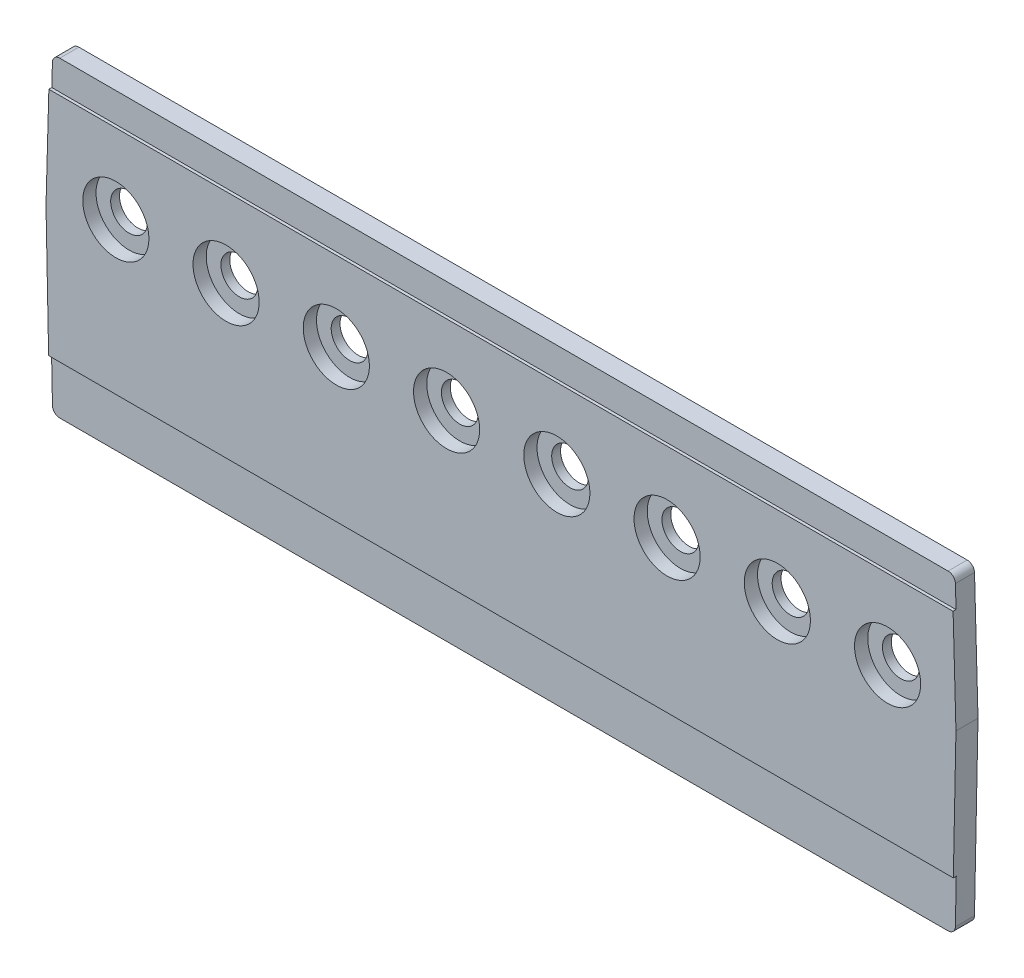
ISO-10303-21;
HEADER;
FILE_DESCRIPTION(('STEP AP214'),'2;1');
FILE_NAME('part.step','',(''),(''),'','','');
FILE_SCHEMA(('AUTOMOTIVE_DESIGN { 1 0 10303 214 1 1 1 1 }'));
ENDSEC;
DATA;
#1=APPLICATION_CONTEXT('core data for automotive mechanical design processes');
#2=APPLICATION_PROTOCOL_DEFINITION('international standard','automotive_design',2000,#1);
#3=PRODUCT_CONTEXT('',#1,'mechanical');
#4=PRODUCT('Part','Part','',(#3));
#5=PRODUCT_RELATED_PRODUCT_CATEGORY('part','',(#4));
#6=PRODUCT_DEFINITION_FORMATION('','',#4);
#7=PRODUCT_DEFINITION_CONTEXT('part definition',#1,'design');
#8=PRODUCT_DEFINITION('design','',#6,#7);
#9=PRODUCT_DEFINITION_SHAPE('','',#8);
#10=(LENGTH_UNIT() NAMED_UNIT(*) SI_UNIT(.MILLI.,.METRE.));
#11=(NAMED_UNIT(*) PLANE_ANGLE_UNIT() SI_UNIT($,.RADIAN.));
#12=(NAMED_UNIT(*) SI_UNIT($,.STERADIAN.) SOLID_ANGLE_UNIT());
#13=UNCERTAINTY_MEASURE_WITH_UNIT(LENGTH_MEASURE(1.E-05),#10,'distance_accuracy_value','');
#14=(GEOMETRIC_REPRESENTATION_CONTEXT(3) GLOBAL_UNCERTAINTY_ASSIGNED_CONTEXT((#13)) GLOBAL_UNIT_ASSIGNED_CONTEXT((#10,
#11,#12)) REPRESENTATION_CONTEXT('',''));
#15=CARTESIAN_POINT('',(0.,0.,0.));
#16=DIRECTION('',(0.,0.,1.));
#17=DIRECTION('',(1.,0.,0.));
#18=AXIS2_PLACEMENT_3D('',#15,#16,#17);
#19=CARTESIAN_POINT('',(122.32019993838,1.,3.));
#20=DIRECTION('',(0.,0.,-1.));
#21=DIRECTION('',(-1.,0.,0.));
#22=AXIS2_PLACEMENT_3D('',#19,#20,#21);
#23=CYLINDRICAL_SURFACE('',#22,1.);
#24=CARTESIAN_POINT('',(122.32019993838,1.,2.6));
#25=DIRECTION('',(0.,0.,1.));
#26=DIRECTION('',(1.,0.,0.));
#27=AXIS2_PLACEMENT_3D('',#24,#25,#26);
#28=CIRCLE('',#27,1.);
#29=CARTESIAN_POINT('',(122.32019993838,0.,2.6));
#30=VERTEX_POINT('',#29);
#31=CARTESIAN_POINT('',(123.319991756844,0.979596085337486,2.6));
#32=VERTEX_POINT('',#31);
#33=EDGE_CURVE('E143',#30,#32,#28,.T.);
#34=ORIENTED_EDGE('',*,*,#33,.F.);
#35=DIRECTION('',(0.,0.,-1.));
#36=VECTOR('',#35,1.);
#37=CARTESIAN_POINT('',(122.32019993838,0.,3.));
#38=LINE('',#37,#36);
#39=CARTESIAN_POINT('',(122.32019993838,0.,0.));
#40=VERTEX_POINT('',#39);
#41=EDGE_CURVE('E172',#30,#40,#38,.T.);
#42=ORIENTED_EDGE('',*,*,#41,.T.);
#43=CARTESIAN_POINT('',(122.32019993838,1.,0.));
#44=DIRECTION('',(0.,0.,1.));
#45=DIRECTION('',(-1.,0.,0.));
#46=AXIS2_PLACEMENT_3D('',#43,#44,#45);
#47=CIRCLE('',#46,1.);
#48=CARTESIAN_POINT('',(123.319991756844,0.979596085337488,0.));
#49=VERTEX_POINT('',#48);
#50=EDGE_CURVE('E173',#40,#49,#47,.T.);
#51=ORIENTED_EDGE('',*,*,#50,.T.);
#52=DIRECTION('',(0.,0.,-1.));
#53=VECTOR('',#52,1.);
#54=CARTESIAN_POINT('',(123.319991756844,0.979596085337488,3.));
#55=LINE('',#54,#53);
#56=EDGE_CURVE('E214',#32,#49,#55,.T.);
#57=ORIENTED_EDGE('',*,*,#56,.F.);
#58=EDGE_LOOP('',(#34,#42,#51,#57));
#59=FACE_BOUND('',#58,.T.);
#60=ADVANCED_FACE('F33',(#59),#23,.T.);
#61=CARTESIAN_POINT('',(1.47980006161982,1.,3.));
#62=DIRECTION('',(0.,0.,-1.));
#63=DIRECTION('',(-1.,0.,0.));
#64=AXIS2_PLACEMENT_3D('',#61,#62,#63);
#65=CYLINDRICAL_SURFACE('',#64,1.);
#66=CARTESIAN_POINT('',(1.47980006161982,1.,2.6));
#67=DIRECTION('',(0.,0.,1.));
#68=DIRECTION('',(1.,0.,0.));
#69=AXIS2_PLACEMENT_3D('',#66,#67,#68);
#70=CIRCLE('',#69,1.);
#71=CARTESIAN_POINT('',(0.480008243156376,0.979596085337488,2.6));
#72=VERTEX_POINT('',#71);
#73=CARTESIAN_POINT('',(1.47980006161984,0.,2.6));
#74=VERTEX_POINT('',#73);
#75=EDGE_CURVE('E47',#72,#74,#70,.T.);
#76=ORIENTED_EDGE('',*,*,#75,.F.);
#77=DIRECTION('',(0.,0.,-1.));
#78=VECTOR('',#77,1.);
#79=CARTESIAN_POINT('',(0.480008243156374,0.979596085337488,3.));
#80=LINE('',#79,#78);
#81=CARTESIAN_POINT('',(0.480008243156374,0.979596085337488,0.));
#82=VERTEX_POINT('',#81);
#83=EDGE_CURVE('E200',#72,#82,#80,.T.);
#84=ORIENTED_EDGE('',*,*,#83,.T.);
#85=CARTESIAN_POINT('',(1.47980006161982,1.,0.));
#86=DIRECTION('',(0.,0.,1.));
#87=DIRECTION('',(1.,0.,0.));
#88=AXIS2_PLACEMENT_3D('',#85,#86,#87);
#89=CIRCLE('',#88,1.);
#90=CARTESIAN_POINT('',(1.47980006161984,0.,0.));
#91=VERTEX_POINT('',#90);
#92=EDGE_CURVE('E164',#82,#91,#89,.T.);
#93=ORIENTED_EDGE('',*,*,#92,.T.);
#94=DIRECTION('',(0.,0.,-1.));
#95=VECTOR('',#94,1.);
#96=CARTESIAN_POINT('',(1.47980006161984,0.,3.));
#97=LINE('',#96,#95);
#98=EDGE_CURVE('E198',#74,#91,#97,.T.);
#99=ORIENTED_EDGE('',*,*,#98,.F.);
#100=EDGE_LOOP('',(#76,#84,#93,#99));
#101=FACE_BOUND('',#100,.T.);
#102=ADVANCED_FACE('F402',(#101),#65,.T.);
#103=CARTESIAN_POINT('',(1.47980006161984,0.,3.));
#104=DIRECTION('',(0.,1.,0.));
#105=DIRECTION('',(0.,0.,1.));
#106=AXIS2_PLACEMENT_3D('',#103,#104,#105);
#107=PLANE('',#106);
#108=DIRECTION('',(1.,0.,0.));
#109=VECTOR('',#108,1.);
#110=CARTESIAN_POINT('',(1.47980006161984,0.,2.6));
#111=LINE('',#110,#109);
#112=EDGE_CURVE('E40',#74,#30,#111,.T.);
#113=ORIENTED_EDGE('',*,*,#112,.F.);
#114=ORIENTED_EDGE('',*,*,#98,.T.);
#115=DIRECTION('',(1.,0.,0.));
#116=VECTOR('',#115,1.);
#117=CARTESIAN_POINT('',(1.47980006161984,0.,0.));
#118=LINE('',#117,#116);
#119=EDGE_CURVE('E159',#91,#40,#118,.T.);
#120=ORIENTED_EDGE('',*,*,#119,.T.);
#121=ORIENTED_EDGE('',*,*,#41,.F.);
#122=EDGE_LOOP('',(#113,#114,#120,#121));
#123=FACE_BOUND('',#122,.T.);
#124=ADVANCED_FACE('F269',(#123),#107,.F.);
#125=CARTESIAN_POINT('',(122.327542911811,41.4,3.));
#126=DIRECTION('',(0.,0.,-1.));
#127=DIRECTION('',(-1.,0.,0.));
#128=AXIS2_PLACEMENT_3D('',#125,#126,#127);
#129=CYLINDRICAL_SURFACE('',#128,0.999999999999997);
#130=CARTESIAN_POINT('',(122.327542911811,41.4,2.6));
#131=DIRECTION('',(0.,0.,1.));
#132=DIRECTION('',(1.,0.,0.));
#133=AXIS2_PLACEMENT_3D('',#130,#131,#132);
#134=CIRCLE('',#133,0.999999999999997);
#135=CARTESIAN_POINT('',(123.327153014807,41.4279220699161,2.6));
#136=VERTEX_POINT('',#135);
#137=CARTESIAN_POINT('',(122.327542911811,42.4,2.6));
#138=VERTEX_POINT('',#137);
#139=EDGE_CURVE('E310',#136,#138,#134,.T.);
#140=ORIENTED_EDGE('',*,*,#139,.F.);
#141=DIRECTION('',(0.,0.,-1.));
#142=VECTOR('',#141,1.);
#143=CARTESIAN_POINT('',(123.327153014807,41.4279220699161,3.));
#144=LINE('',#143,#142);
#145=CARTESIAN_POINT('',(123.327153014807,41.4279220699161,0.));
#146=VERTEX_POINT('',#145);
#147=EDGE_CURVE('E211',#136,#146,#144,.T.);
#148=ORIENTED_EDGE('',*,*,#147,.T.);
#149=CARTESIAN_POINT('',(122.327542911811,41.4,0.));
#150=DIRECTION('',(0.,0.,1.));
#151=DIRECTION('',(1.,0.,0.));
#152=AXIS2_PLACEMENT_3D('',#149,#150,#151);
#153=CIRCLE('',#152,0.999999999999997);
#154=CARTESIAN_POINT('',(122.327542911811,42.4,0.));
#155=VERTEX_POINT('',#154);
#156=EDGE_CURVE('E181',#146,#155,#153,.T.);
#157=ORIENTED_EDGE('',*,*,#156,.T.);
#158=DIRECTION('',(0.,0.,-1.));
#159=VECTOR('',#158,1.);
#160=CARTESIAN_POINT('',(122.327542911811,42.4,3.));
#161=LINE('',#160,#159);
#162=EDGE_CURVE('E209',#138,#155,#161,.T.);
#163=ORIENTED_EDGE('',*,*,#162,.F.);
#164=EDGE_LOOP('',(#140,#148,#157,#163));
#165=FACE_BOUND('',#164,.T.);
#166=ADVANCED_FACE('F411',(#165),#129,.T.);
#167=CARTESIAN_POINT('',(1.47245708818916,42.4,3.));
#168=DIRECTION('',(0.,-1.,0.));
#169=DIRECTION('',(0.,0.,-1.));
#170=AXIS2_PLACEMENT_3D('',#167,#168,#169);
#171=PLANE('',#170);
#172=DIRECTION('',(-1.,0.,0.));
#173=VECTOR('',#172,1.);
#174=CARTESIAN_POINT('',(0.,42.4,2.6));
#175=LINE('',#174,#173);
#176=CARTESIAN_POINT('',(1.47245708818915,42.4,2.6));
#177=VERTEX_POINT('',#176);
#178=EDGE_CURVE('E307',#138,#177,#175,.T.);
#179=ORIENTED_EDGE('',*,*,#178,.F.);
#180=ORIENTED_EDGE('',*,*,#162,.T.);
#181=DIRECTION('',(-1.,0.,0.));
#182=VECTOR('',#181,1.);
#183=CARTESIAN_POINT('',(1.47245708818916,42.4,0.));
#184=LINE('',#183,#182);
#185=CARTESIAN_POINT('',(1.47245708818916,42.4,0.));
#186=VERTEX_POINT('',#185);
#187=EDGE_CURVE('E184',#155,#186,#184,.T.);
#188=ORIENTED_EDGE('',*,*,#187,.T.);
#189=DIRECTION('',(0.,0.,-1.));
#190=VECTOR('',#189,1.);
#191=CARTESIAN_POINT('',(1.47245708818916,42.4,3.));
#192=LINE('',#191,#190);
#193=EDGE_CURVE('E207',#177,#186,#192,.T.);
#194=ORIENTED_EDGE('',*,*,#193,.F.);
#195=EDGE_LOOP('',(#179,#180,#188,#194));
#196=FACE_BOUND('',#195,.T.);
#197=ADVANCED_FACE('F422',(#196),#171,.F.);
#198=CARTESIAN_POINT('',(1.47245708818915,41.4,3.));
#199=DIRECTION('',(0.,0.,-1.));
#200=DIRECTION('',(-1.,0.,0.));
#201=AXIS2_PLACEMENT_3D('',#198,#199,#200);
#202=CYLINDRICAL_SURFACE('',#201,0.999999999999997);
#203=CARTESIAN_POINT('',(1.47245708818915,41.4,2.6));
#204=DIRECTION('',(0.,0.,1.));
#205=DIRECTION('',(1.,0.,0.));
#206=AXIS2_PLACEMENT_3D('',#203,#204,#205);
#207=CIRCLE('',#206,0.999999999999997);
#208=CARTESIAN_POINT('',(0.472846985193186,41.4279220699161,2.6));
#209=VERTEX_POINT('',#208);
#210=EDGE_CURVE('E55',#177,#209,#207,.T.);
#211=ORIENTED_EDGE('',*,*,#210,.F.);
#212=ORIENTED_EDGE('',*,*,#193,.T.);
#213=CARTESIAN_POINT('',(1.47245708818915,41.4,0.));
#214=DIRECTION('',(0.,0.,1.));
#215=DIRECTION('',(-1.,0.,0.));
#216=AXIS2_PLACEMENT_3D('',#213,#214,#215);
#217=CIRCLE('',#216,0.999999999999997);
#218=CARTESIAN_POINT('',(0.472846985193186,41.4279220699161,0.));
#219=VERTEX_POINT('',#218);
#220=EDGE_CURVE('E187',#186,#219,#217,.T.);
#221=ORIENTED_EDGE('',*,*,#220,.T.);
#222=DIRECTION('',(0.,0.,-1.));
#223=VECTOR('',#222,1.);
#224=CARTESIAN_POINT('',(0.472846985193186,41.4279220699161,3.));
#225=LINE('',#224,#223);
#226=EDGE_CURVE('E205',#209,#219,#225,.T.);
#227=ORIENTED_EDGE('',*,*,#226,.F.);
#228=EDGE_LOOP('',(#211,#212,#221,#227));
#229=FACE_BOUND('',#228,.T.);
#230=ADVANCED_FACE('F418',(#229),#202,.T.);
#231=CARTESIAN_POINT('',(114.5,27.6,3.));
#232=DIRECTION('',(0.,0.,-1.));
#233=DIRECTION('',(-1.,0.,0.));
#234=AXIS2_PLACEMENT_3D('',#231,#232,#233);
#235=CYLINDRICAL_SURFACE('',#234,2.50000000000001);
#236=CARTESIAN_POINT('',(114.5,27.6,0.));
#237=DIRECTION('',(0.,0.,1.));
#238=DIRECTION('',(1.,0.,0.));
#239=AXIS2_PLACEMENT_3D('',#236,#237,#238);
#240=CIRCLE('',#239,2.50000000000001);
#241=CARTESIAN_POINT('',(117.,27.6,0.));
#242=VERTEX_POINT('',#241);
#243=EDGE_CURVE('E220',#242,#242,#240,.T.);
#244=ORIENTED_EDGE('',*,*,#243,.F.);
#245=EDGE_LOOP('',(#244));
#246=FACE_BOUND('',#245,.T.);
#247=CARTESIAN_POINT('',(114.5,27.6,1.2));
#248=DIRECTION('',(0.,0.,1.));
#249=DIRECTION('',(1.,0.,0.));
#250=AXIS2_PLACEMENT_3D('',#247,#248,#249);
#251=CIRCLE('',#250,2.50000000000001);
#252=CARTESIAN_POINT('',(117.,27.6,1.2));
#253=VERTEX_POINT('',#252);
#254=EDGE_CURVE('E252',#253,#253,#251,.T.);
#255=ORIENTED_EDGE('',*,*,#254,.T.);
#256=EDGE_LOOP('',(#255));
#257=FACE_BOUND('',#256,.T.);
#258=ADVANCED_FACE('F421',(#246,#257),#235,.F.);
#259=CARTESIAN_POINT('',(99.5,27.6,3.));
#260=DIRECTION('',(0.,0.,-1.));
#261=DIRECTION('',(-1.,0.,0.));
#262=AXIS2_PLACEMENT_3D('',#259,#260,#261);
#263=CYLINDRICAL_SURFACE('',#262,2.50000000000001);
#264=CARTESIAN_POINT('',(99.5,27.6,0.));
#265=DIRECTION('',(0.,0.,1.));
#266=DIRECTION('',(1.,0.,0.));
#267=AXIS2_PLACEMENT_3D('',#264,#265,#266);
#268=CIRCLE('',#267,2.50000000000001);
#269=CARTESIAN_POINT('',(102.,27.6,0.));
#270=VERTEX_POINT('',#269);
#271=EDGE_CURVE('E350',#270,#270,#268,.T.);
#272=ORIENTED_EDGE('',*,*,#271,.F.);
#273=EDGE_LOOP('',(#272));
#274=FACE_BOUND('',#273,.T.);
#275=CARTESIAN_POINT('',(99.5,27.6,1.2));
#276=DIRECTION('',(0.,0.,1.));
#277=DIRECTION('',(1.,0.,0.));
#278=AXIS2_PLACEMENT_3D('',#275,#276,#277);
#279=CIRCLE('',#278,2.50000000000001);
#280=CARTESIAN_POINT('',(102.,27.6,1.2));
#281=VERTEX_POINT('',#280);
#282=EDGE_CURVE('E247',#281,#281,#279,.T.);
#283=ORIENTED_EDGE('',*,*,#282,.T.);
#284=EDGE_LOOP('',(#283));
#285=FACE_BOUND('',#284,.T.);
#286=ADVANCED_FACE('F670',(#274,#285),#263,.F.);
#287=CARTESIAN_POINT('',(84.5,27.6,3.));
#288=DIRECTION('',(0.,0.,-1.));
#289=DIRECTION('',(-1.,0.,0.));
#290=AXIS2_PLACEMENT_3D('',#287,#288,#289);
#291=CYLINDRICAL_SURFACE('',#290,2.5);
#292=CARTESIAN_POINT('',(84.5,27.6,0.));
#293=DIRECTION('',(0.,0.,1.));
#294=DIRECTION('',(1.,0.,0.));
#295=AXIS2_PLACEMENT_3D('',#292,#293,#294);
#296=CIRCLE('',#295,2.5);
#297=CARTESIAN_POINT('',(87.,27.6,0.));
#298=VERTEX_POINT('',#297);
#299=EDGE_CURVE('E353',#298,#298,#296,.T.);
#300=ORIENTED_EDGE('',*,*,#299,.F.);
#301=EDGE_LOOP('',(#300));
#302=FACE_BOUND('',#301,.T.);
#303=CARTESIAN_POINT('',(84.5,27.6,1.2));
#304=DIRECTION('',(0.,0.,1.));
#305=DIRECTION('',(1.,0.,0.));
#306=AXIS2_PLACEMENT_3D('',#303,#304,#305);
#307=CIRCLE('',#306,2.5);
#308=CARTESIAN_POINT('',(87.,27.6,1.2));
#309=VERTEX_POINT('',#308);
#310=EDGE_CURVE('E242',#309,#309,#307,.T.);
#311=ORIENTED_EDGE('',*,*,#310,.T.);
#312=EDGE_LOOP('',(#311));
#313=FACE_BOUND('',#312,.T.);
#314=ADVANCED_FACE('F679',(#302,#313),#291,.F.);
#315=CARTESIAN_POINT('',(69.5,27.6,3.));
#316=DIRECTION('',(0.,0.,-1.));
#317=DIRECTION('',(-1.,0.,0.));
#318=AXIS2_PLACEMENT_3D('',#315,#316,#317);
#319=CYLINDRICAL_SURFACE('',#318,2.50000000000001);
#320=CARTESIAN_POINT('',(69.5,27.6,0.));
#321=DIRECTION('',(0.,0.,1.));
#322=DIRECTION('',(1.,0.,0.));
#323=AXIS2_PLACEMENT_3D('',#320,#321,#322);
#324=CIRCLE('',#323,2.50000000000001);
#325=CARTESIAN_POINT('',(72.,27.6,0.));
#326=VERTEX_POINT('',#325);
#327=EDGE_CURVE('E356',#326,#326,#324,.T.);
#328=ORIENTED_EDGE('',*,*,#327,.F.);
#329=EDGE_LOOP('',(#328));
#330=FACE_BOUND('',#329,.T.);
#331=CARTESIAN_POINT('',(69.5,27.6,1.2));
#332=DIRECTION('',(0.,0.,1.));
#333=DIRECTION('',(1.,0.,0.));
#334=AXIS2_PLACEMENT_3D('',#331,#332,#333);
#335=CIRCLE('',#334,2.50000000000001);
#336=CARTESIAN_POINT('',(72.,27.6,1.2));
#337=VERTEX_POINT('',#336);
#338=EDGE_CURVE('E237',#337,#337,#335,.T.);
#339=ORIENTED_EDGE('',*,*,#338,.T.);
#340=EDGE_LOOP('',(#339));
#341=FACE_BOUND('',#340,.T.);
#342=ADVANCED_FACE('F688',(#330,#341),#319,.F.);
#343=CARTESIAN_POINT('',(54.5,27.6,3.));
#344=DIRECTION('',(0.,0.,-1.));
#345=DIRECTION('',(-1.,0.,0.));
#346=AXIS2_PLACEMENT_3D('',#343,#344,#345);
#347=CYLINDRICAL_SURFACE('',#346,2.5);
#348=CARTESIAN_POINT('',(54.5,27.6,0.));
#349=DIRECTION('',(0.,0.,1.));
#350=DIRECTION('',(1.,0.,0.));
#351=AXIS2_PLACEMENT_3D('',#348,#349,#350);
#352=CIRCLE('',#351,2.5);
#353=CARTESIAN_POINT('',(57.,27.6,0.));
#354=VERTEX_POINT('',#353);
#355=EDGE_CURVE('E359',#354,#354,#352,.T.);
#356=ORIENTED_EDGE('',*,*,#355,.F.);
#357=EDGE_LOOP('',(#356));
#358=FACE_BOUND('',#357,.T.);
#359=CARTESIAN_POINT('',(54.5,27.6,1.2));
#360=DIRECTION('',(0.,0.,1.));
#361=DIRECTION('',(1.,0.,0.));
#362=AXIS2_PLACEMENT_3D('',#359,#360,#361);
#363=CIRCLE('',#362,2.5);
#364=CARTESIAN_POINT('',(57.,27.6,1.2));
#365=VERTEX_POINT('',#364);
#366=EDGE_CURVE('E232',#365,#365,#363,.T.);
#367=ORIENTED_EDGE('',*,*,#366,.T.);
#368=EDGE_LOOP('',(#367));
#369=FACE_BOUND('',#368,.T.);
#370=ADVANCED_FACE('F697',(#358,#369),#347,.F.);
#371=CARTESIAN_POINT('',(39.5,27.6,3.));
#372=DIRECTION('',(0.,0.,-1.));
#373=DIRECTION('',(-1.,0.,0.));
#374=AXIS2_PLACEMENT_3D('',#371,#372,#373);
#375=CYLINDRICAL_SURFACE('',#374,2.5);
#376=CARTESIAN_POINT('',(39.5,27.6,0.));
#377=DIRECTION('',(0.,0.,1.));
#378=DIRECTION('',(1.,0.,0.));
#379=AXIS2_PLACEMENT_3D('',#376,#377,#378);
#380=CIRCLE('',#379,2.5);
#381=CARTESIAN_POINT('',(42.,27.6,0.));
#382=VERTEX_POINT('',#381);
#383=EDGE_CURVE('E362',#382,#382,#380,.T.);
#384=ORIENTED_EDGE('',*,*,#383,.F.);
#385=EDGE_LOOP('',(#384));
#386=FACE_BOUND('',#385,.T.);
#387=CARTESIAN_POINT('',(39.5,27.6,1.2));
#388=DIRECTION('',(0.,0.,1.));
#389=DIRECTION('',(1.,0.,0.));
#390=AXIS2_PLACEMENT_3D('',#387,#388,#389);
#391=CIRCLE('',#390,2.5);
#392=CARTESIAN_POINT('',(42.,27.6,1.2));
#393=VERTEX_POINT('',#392);
#394=EDGE_CURVE('E227',#393,#393,#391,.T.);
#395=ORIENTED_EDGE('',*,*,#394,.T.);
#396=EDGE_LOOP('',(#395));
#397=FACE_BOUND('',#396,.T.);
#398=ADVANCED_FACE('F706',(#386,#397),#375,.F.);
#399=CARTESIAN_POINT('',(24.5,27.6,3.));
#400=DIRECTION('',(0.,0.,-1.));
#401=DIRECTION('',(-1.,0.,0.));
#402=AXIS2_PLACEMENT_3D('',#399,#400,#401);
#403=CYLINDRICAL_SURFACE('',#402,2.5);
#404=CARTESIAN_POINT('',(24.5,27.6,0.));
#405=DIRECTION('',(0.,0.,1.));
#406=DIRECTION('',(1.,0.,0.));
#407=AXIS2_PLACEMENT_3D('',#404,#405,#406);
#408=CIRCLE('',#407,2.5);
#409=CARTESIAN_POINT('',(27.,27.6,0.));
#410=VERTEX_POINT('',#409);
#411=EDGE_CURVE('E364',#410,#410,#408,.T.);
#412=ORIENTED_EDGE('',*,*,#411,.F.);
#413=EDGE_LOOP('',(#412));
#414=FACE_BOUND('',#413,.T.);
#415=CARTESIAN_POINT('',(24.5,27.6,1.2));
#416=DIRECTION('',(0.,0.,1.));
#417=DIRECTION('',(1.,0.,0.));
#418=AXIS2_PLACEMENT_3D('',#415,#416,#417);
#419=CIRCLE('',#418,2.5);
#420=CARTESIAN_POINT('',(27.,27.6,1.2));
#421=VERTEX_POINT('',#420);
#422=EDGE_CURVE('E222',#421,#421,#419,.T.);
#423=ORIENTED_EDGE('',*,*,#422,.T.);
#424=EDGE_LOOP('',(#423));
#425=FACE_BOUND('',#424,.T.);
#426=ADVANCED_FACE('F374',(#414,#425),#403,.F.);
#427=CARTESIAN_POINT('',(9.5,27.6,3.));
#428=DIRECTION('',(0.,0.,-1.));
#429=DIRECTION('',(-1.,0.,0.));
#430=AXIS2_PLACEMENT_3D('',#427,#428,#429);
#431=CYLINDRICAL_SURFACE('',#430,2.5);
#432=CARTESIAN_POINT('',(9.5,27.6,0.));
#433=DIRECTION('',(0.,0.,1.));
#434=DIRECTION('',(1.,0.,0.));
#435=AXIS2_PLACEMENT_3D('',#432,#433,#434);
#436=CIRCLE('',#435,2.5);
#437=CARTESIAN_POINT('',(12.,27.6,0.));
#438=VERTEX_POINT('',#437);
#439=EDGE_CURVE('E167',#438,#438,#436,.T.);
#440=ORIENTED_EDGE('',*,*,#439,.F.);
#441=EDGE_LOOP('',(#440));
#442=FACE_BOUND('',#441,.T.);
#443=CARTESIAN_POINT('',(9.5,27.6,1.2));
#444=DIRECTION('',(0.,0.,1.));
#445=DIRECTION('',(1.,0.,0.));
#446=AXIS2_PLACEMENT_3D('',#443,#444,#445);
#447=CIRCLE('',#446,2.5);
#448=CARTESIAN_POINT('',(12.,27.6,1.2));
#449=VERTEX_POINT('',#448);
#450=EDGE_CURVE('E217',#449,#449,#447,.T.);
#451=ORIENTED_EDGE('',*,*,#450,.T.);
#452=EDGE_LOOP('',(#451));
#453=FACE_BOUND('',#452,.T.);
#454=ADVANCED_FACE('F371',(#442,#453),#431,.F.);
#455=CARTESIAN_POINT('',(122.32019993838,1.,3.));
#456=DIRECTION('',(0.,0.,-1.));
#457=DIRECTION('',(-1.,0.,0.));
#458=AXIS2_PLACEMENT_3D('',#455,#456,#457);
#459=PLANE('',#458);
#460=CARTESIAN_POINT('',(114.5,27.6,3.));
#461=DIRECTION('',(0.,0.,1.));
#462=DIRECTION('',(1.,0.,0.));
#463=AXIS2_PLACEMENT_3D('',#460,#461,#462);
#464=CIRCLE('',#463,4.5);
#465=CARTESIAN_POINT('',(119.,27.6,3.));
#466=VERTEX_POINT('',#465);
#467=EDGE_CURVE('E315',#466,#466,#464,.T.);
#468=ORIENTED_EDGE('',*,*,#467,.F.);
#469=EDGE_LOOP('',(#468));
#470=FACE_BOUND('',#469,.T.);
#471=CARTESIAN_POINT('',(99.5,27.6,3.));
#472=DIRECTION('',(0.,0.,1.));
#473=DIRECTION('',(1.,0.,0.));
#474=AXIS2_PLACEMENT_3D('',#471,#472,#473);
#475=CIRCLE('',#474,4.5);
#476=CARTESIAN_POINT('',(104.,27.6,3.));
#477=VERTEX_POINT('',#476);
#478=EDGE_CURVE('E255',#477,#477,#475,.T.);
#479=ORIENTED_EDGE('',*,*,#478,.F.);
#480=EDGE_LOOP('',(#479));
#481=FACE_BOUND('',#480,.T.);
#482=CARTESIAN_POINT('',(84.5,27.6,3.));
#483=DIRECTION('',(0.,0.,1.));
#484=DIRECTION('',(1.,0.,0.));
#485=AXIS2_PLACEMENT_3D('',#482,#483,#484);
#486=CIRCLE('',#485,4.5);
#487=CARTESIAN_POINT('',(89.,27.6,3.));
#488=VERTEX_POINT('',#487);
#489=EDGE_CURVE('E250',#488,#488,#486,.T.);
#490=ORIENTED_EDGE('',*,*,#489,.F.);
#491=EDGE_LOOP('',(#490));
#492=FACE_BOUND('',#491,.T.);
#493=CARTESIAN_POINT('',(69.5,27.6,3.));
#494=DIRECTION('',(0.,0.,1.));
#495=DIRECTION('',(1.,0.,0.));
#496=AXIS2_PLACEMENT_3D('',#493,#494,#495);
#497=CIRCLE('',#496,4.5);
#498=CARTESIAN_POINT('',(74.,27.6,3.));
#499=VERTEX_POINT('',#498);
#500=EDGE_CURVE('E245',#499,#499,#497,.T.);
#501=ORIENTED_EDGE('',*,*,#500,.F.);
#502=EDGE_LOOP('',(#501));
#503=FACE_BOUND('',#502,.T.);
#504=CARTESIAN_POINT('',(54.5,27.6,3.));
#505=DIRECTION('',(0.,0.,1.));
#506=DIRECTION('',(1.,0.,0.));
#507=AXIS2_PLACEMENT_3D('',#504,#505,#506);
#508=CIRCLE('',#507,4.5);
#509=CARTESIAN_POINT('',(59.,27.6,3.));
#510=VERTEX_POINT('',#509);
#511=EDGE_CURVE('E240',#510,#510,#508,.T.);
#512=ORIENTED_EDGE('',*,*,#511,.F.);
#513=EDGE_LOOP('',(#512));
#514=FACE_BOUND('',#513,.T.);
#515=CARTESIAN_POINT('',(39.5,27.6,3.));
#516=DIRECTION('',(0.,0.,1.));
#517=DIRECTION('',(1.,0.,0.));
#518=AXIS2_PLACEMENT_3D('',#515,#516,#517);
#519=CIRCLE('',#518,4.5);
#520=CARTESIAN_POINT('',(44.,27.6,3.));
#521=VERTEX_POINT('',#520);
#522=EDGE_CURVE('E235',#521,#521,#519,.T.);
#523=ORIENTED_EDGE('',*,*,#522,.F.);
#524=EDGE_LOOP('',(#523));
#525=FACE_BOUND('',#524,.T.);
#526=CARTESIAN_POINT('',(24.5,27.6,3.));
#527=DIRECTION('',(0.,0.,1.));
#528=DIRECTION('',(1.,0.,0.));
#529=AXIS2_PLACEMENT_3D('',#526,#527,#528);
#530=CIRCLE('',#529,4.5);
#531=CARTESIAN_POINT('',(29.,27.6,3.));
#532=VERTEX_POINT('',#531);
#533=EDGE_CURVE('E230',#532,#532,#530,.T.);
#534=ORIENTED_EDGE('',*,*,#533,.F.);
#535=EDGE_LOOP('',(#534));
#536=FACE_BOUND('',#535,.T.);
#537=CARTESIAN_POINT('',(9.5,27.6,3.));
#538=DIRECTION('',(0.,0.,1.));
#539=DIRECTION('',(1.,0.,0.));
#540=AXIS2_PLACEMENT_3D('',#537,#538,#539);
#541=CIRCLE('',#540,4.5);
#542=CARTESIAN_POINT('',(14.,27.6,3.));
#543=VERTEX_POINT('',#542);
#544=EDGE_CURVE('E225',#543,#543,#541,.T.);
#545=ORIENTED_EDGE('',*,*,#544,.F.);
#546=EDGE_LOOP('',(#545));
#547=FACE_BOUND('',#546,.T.);
#548=DIRECTION('',(0.0204039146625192,-0.999791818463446,0.));
#549=VECTOR('',#548,1.);
#550=CARTESIAN_POINT('',(0.,24.5,3.));
#551=LINE('',#550,#549);
#552=CARTESIAN_POINT('',(0.,24.5,3.));
#553=VERTEX_POINT('',#552);
#554=CARTESIAN_POINT('',(0.357142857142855,6.99999999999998,3.));
#555=VERTEX_POINT('',#554);
#556=EDGE_CURVE('E152',#553,#555,#551,.T.);
#557=ORIENTED_EDGE('',*,*,#556,.T.);
#558=DIRECTION('',(-1.,0.,0.));
#559=VECTOR('',#558,1.);
#560=CARTESIAN_POINT('',(-0.959840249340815,6.99999999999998,3.));
#561=LINE('',#560,#559);
#562=CARTESIAN_POINT('',(123.442857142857,6.99999999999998,3.));
#563=VERTEX_POINT('',#562);
#564=EDGE_CURVE('E136',#563,#555,#561,.T.);
#565=ORIENTED_EDGE('',*,*,#564,.F.);
#566=DIRECTION('',(0.0204039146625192,0.999791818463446,0.));
#567=VECTOR('',#566,1.);
#568=CARTESIAN_POINT('',(123.8,24.5,3.));
#569=LINE('',#568,#567);
#570=CARTESIAN_POINT('',(123.8,24.5,3.));
#571=VERTEX_POINT('',#570);
#572=EDGE_CURVE('E149',#563,#571,#569,.T.);
#573=ORIENTED_EDGE('',*,*,#572,.T.);
#574=DIRECTION('',(-0.0279220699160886,0.999610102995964,0.));
#575=VECTOR('',#574,1.);
#576=CARTESIAN_POINT('',(123.8,24.5,3.));
#577=LINE('',#576,#575);
#578=CARTESIAN_POINT('',(123.411731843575,38.4,3.));
#579=VERTEX_POINT('',#578);
#580=EDGE_CURVE('E158',#571,#579,#577,.T.);
#581=ORIENTED_EDGE('',*,*,#580,.T.);
#582=DIRECTION('',(1.,0.,0.));
#583=VECTOR('',#582,1.);
#584=CARTESIAN_POINT('',(0.,38.4,3.));
#585=LINE('',#584,#583);
#586=CARTESIAN_POINT('',(0.388268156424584,38.4,3.));
#587=VERTEX_POINT('',#586);
#588=EDGE_CURVE('E142',#587,#579,#585,.T.);
#589=ORIENTED_EDGE('',*,*,#588,.F.);
#590=DIRECTION('',(-0.0279220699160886,-0.999610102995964,0.));
#591=VECTOR('',#590,1.);
#592=CARTESIAN_POINT('',(0.,24.5,3.));
#593=LINE('',#592,#591);
#594=EDGE_CURVE('E161',#587,#553,#593,.T.);
#595=ORIENTED_EDGE('',*,*,#594,.T.);
#596=EDGE_LOOP('',(#557,#565,#573,#581,#589,#595));
#597=FACE_BOUND('',#596,.T.);
#598=ADVANCED_FACE('F147',(#470,#481,#492,#503,#514,#525,#536,#547,#597),#459,.F.);
#599=CARTESIAN_POINT('',(122.32019993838,1.,0.));
#600=DIRECTION('',(0.,0.,-1.));
#601=DIRECTION('',(-1.,0.,0.));
#602=AXIS2_PLACEMENT_3D('',#599,#600,#601);
#603=PLANE('',#602);
#604=ORIENTED_EDGE('',*,*,#271,.T.);
#605=EDGE_LOOP('',(#604));
#606=FACE_BOUND('',#605,.T.);
#607=ORIENTED_EDGE('',*,*,#327,.T.);
#608=EDGE_LOOP('',(#607));
#609=FACE_BOUND('',#608,.T.);
#610=ORIENTED_EDGE('',*,*,#383,.T.);
#611=EDGE_LOOP('',(#610));
#612=FACE_BOUND('',#611,.T.);
#613=ORIENTED_EDGE('',*,*,#439,.T.);
#614=EDGE_LOOP('',(#613));
#615=FACE_BOUND('',#614,.T.);
#616=ORIENTED_EDGE('',*,*,#50,.F.);
#617=ORIENTED_EDGE('',*,*,#119,.F.);
#618=ORIENTED_EDGE('',*,*,#92,.F.);
#619=DIRECTION('',(0.0204039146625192,-0.999791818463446,0.));
#620=VECTOR('',#619,1.);
#621=CARTESIAN_POINT('',(0.,24.5,0.));
#622=LINE('',#621,#620);
#623=CARTESIAN_POINT('',(0.,24.5,0.));
#624=VERTEX_POINT('',#623);
#625=EDGE_CURVE('E192',#624,#82,#622,.T.);
#626=ORIENTED_EDGE('',*,*,#625,.F.);
#627=DIRECTION('',(-0.0279220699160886,-0.999610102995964,0.));
#628=VECTOR('',#627,1.);
#629=CARTESIAN_POINT('',(0.,24.5,0.));
#630=LINE('',#629,#628);
#631=EDGE_CURVE('E190',#219,#624,#630,.T.);
#632=ORIENTED_EDGE('',*,*,#631,.F.);
#633=ORIENTED_EDGE('',*,*,#220,.F.);
#634=ORIENTED_EDGE('',*,*,#187,.F.);
#635=ORIENTED_EDGE('',*,*,#156,.F.);
#636=DIRECTION('',(-0.0279220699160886,0.999610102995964,0.));
#637=VECTOR('',#636,1.);
#638=CARTESIAN_POINT('',(123.8,24.5,0.));
#639=LINE('',#638,#637);
#640=CARTESIAN_POINT('',(123.8,24.5,0.));
#641=VERTEX_POINT('',#640);
#642=EDGE_CURVE('E178',#641,#146,#639,.T.);
#643=ORIENTED_EDGE('',*,*,#642,.F.);
#644=DIRECTION('',(0.0204039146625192,0.999791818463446,0.));
#645=VECTOR('',#644,1.);
#646=CARTESIAN_POINT('',(123.8,24.5,0.));
#647=LINE('',#646,#645);
#648=EDGE_CURVE('E176',#49,#641,#647,.T.);
#649=ORIENTED_EDGE('',*,*,#648,.F.);
#650=EDGE_LOOP('',(#616,#617,#618,#626,#632,#633,#634,#635,#643,#649));
#651=FACE_BOUND('',#650,.T.);
#652=ORIENTED_EDGE('',*,*,#411,.T.);
#653=EDGE_LOOP('',(#652));
#654=FACE_BOUND('',#653,.T.);
#655=ORIENTED_EDGE('',*,*,#355,.T.);
#656=EDGE_LOOP('',(#655));
#657=FACE_BOUND('',#656,.T.);
#658=ORIENTED_EDGE('',*,*,#299,.T.);
#659=EDGE_LOOP('',(#658));
#660=FACE_BOUND('',#659,.T.);
#661=ORIENTED_EDGE('',*,*,#243,.T.);
#662=EDGE_LOOP('',(#661));
#663=FACE_BOUND('',#662,.T.);
#664=ADVANCED_FACE('F275',(#606,#609,#612,#615,#651,#654,#657,#660,#663),#603,.T.);
#665=CARTESIAN_POINT('',(123.8,24.5,3.));
#666=DIRECTION('',(-0.999791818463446,0.0204039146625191,0.));
#667=DIRECTION('',(-0.0204039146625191,-0.999791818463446,0.));
#668=AXIS2_PLACEMENT_3D('',#665,#666,#667);
#669=PLANE('',#668);
#670=ORIENTED_EDGE('',*,*,#572,.F.);
#671=DIRECTION('',(0.,0.,-1.));
#672=VECTOR('',#671,1.);
#673=CARTESIAN_POINT('',(123.442857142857,6.99999999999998,3.));
#674=LINE('',#673,#672);
#675=CARTESIAN_POINT('',(123.442857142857,6.99999999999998,2.6));
#676=VERTEX_POINT('',#675);
#677=EDGE_CURVE('E133',#563,#676,#674,.T.);
#678=ORIENTED_EDGE('',*,*,#677,.T.);
#679=DIRECTION('',(0.0204039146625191,0.999791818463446,0.));
#680=VECTOR('',#679,1.);
#681=CARTESIAN_POINT('',(123.8,24.5,2.6));
#682=LINE('',#681,#680);
#683=EDGE_CURVE('E267',#32,#676,#682,.T.);
#684=ORIENTED_EDGE('',*,*,#683,.F.);
#685=ORIENTED_EDGE('',*,*,#56,.T.);
#686=ORIENTED_EDGE('',*,*,#648,.T.);
#687=DIRECTION('',(0.,0.,-1.));
#688=VECTOR('',#687,1.);
#689=CARTESIAN_POINT('',(123.8,24.5,3.));
#690=LINE('',#689,#688);
#691=EDGE_CURVE('E156',#571,#641,#690,.T.);
#692=ORIENTED_EDGE('',*,*,#691,.F.);
#693=EDGE_LOOP('',(#670,#678,#684,#685,#686,#692));
#694=FACE_BOUND('',#693,.T.);
#695=ADVANCED_FACE('F154',(#694),#669,.F.);
#696=CARTESIAN_POINT('',(123.8,24.5,3.));
#697=DIRECTION('',(-0.999610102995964,-0.0279220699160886,0.));
#698=DIRECTION('',(0.0279220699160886,-0.999610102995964,0.));
#699=AXIS2_PLACEMENT_3D('',#696,#697,#698);
#700=PLANE('',#699);
#701=DIRECTION('',(-0.0279220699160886,0.999610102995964,0.));
#702=VECTOR('',#701,1.);
#703=CARTESIAN_POINT('',(123.8,24.5,2.6));
#704=LINE('',#703,#702);
#705=CARTESIAN_POINT('',(123.411731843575,38.4,2.6));
#706=VERTEX_POINT('',#705);
#707=EDGE_CURVE('E312',#706,#136,#704,.T.);
#708=ORIENTED_EDGE('',*,*,#707,.F.);
#709=DIRECTION('',(0.,0.,1.));
#710=VECTOR('',#709,1.);
#711=CARTESIAN_POINT('',(123.411731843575,38.4,3.));
#712=LINE('',#711,#710);
#713=EDGE_CURVE('E284',#706,#579,#712,.T.);
#714=ORIENTED_EDGE('',*,*,#713,.T.);
#715=ORIENTED_EDGE('',*,*,#580,.F.);
#716=ORIENTED_EDGE('',*,*,#691,.T.);
#717=ORIENTED_EDGE('',*,*,#642,.T.);
#718=ORIENTED_EDGE('',*,*,#147,.F.);
#719=EDGE_LOOP('',(#708,#714,#715,#716,#717,#718));
#720=FACE_BOUND('',#719,.T.);
#721=ADVANCED_FACE('F281',(#720),#700,.F.);
#722=CARTESIAN_POINT('',(0.,24.5,3.));
#723=DIRECTION('',(0.999610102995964,-0.0279220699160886,0.));
#724=DIRECTION('',(0.0279220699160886,0.999610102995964,0.));
#725=AXIS2_PLACEMENT_3D('',#722,#723,#724);
#726=PLANE('',#725);
#727=ORIENTED_EDGE('',*,*,#594,.F.);
#728=DIRECTION('',(0.,0.,-1.));
#729=VECTOR('',#728,1.);
#730=CARTESIAN_POINT('',(0.388268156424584,38.4,3.));
#731=LINE('',#730,#729);
#732=CARTESIAN_POINT('',(0.388268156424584,38.4,2.6));
#733=VERTEX_POINT('',#732);
#734=EDGE_CURVE('E258',#587,#733,#731,.T.);
#735=ORIENTED_EDGE('',*,*,#734,.T.);
#736=DIRECTION('',(-0.0279220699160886,-0.999610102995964,0.));
#737=VECTOR('',#736,1.);
#738=CARTESIAN_POINT('',(0.,24.5,2.6));
#739=LINE('',#738,#737);
#740=EDGE_CURVE('E216',#209,#733,#739,.T.);
#741=ORIENTED_EDGE('',*,*,#740,.F.);
#742=ORIENTED_EDGE('',*,*,#226,.T.);
#743=ORIENTED_EDGE('',*,*,#631,.T.);
#744=DIRECTION('',(0.,0.,-1.));
#745=VECTOR('',#744,1.);
#746=CARTESIAN_POINT('',(0.,24.5,3.));
#747=LINE('',#746,#745);
#748=EDGE_CURVE('E202',#553,#624,#747,.T.);
#749=ORIENTED_EDGE('',*,*,#748,.F.);
#750=EDGE_LOOP('',(#727,#735,#741,#742,#743,#749));
#751=FACE_BOUND('',#750,.T.);
#752=ADVANCED_FACE('F292',(#751),#726,.F.);
#753=CARTESIAN_POINT('',(0.,24.5,3.));
#754=DIRECTION('',(0.999791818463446,0.0204039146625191,0.));
#755=DIRECTION('',(-0.0204039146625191,0.999791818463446,0.));
#756=AXIS2_PLACEMENT_3D('',#753,#754,#755);
#757=PLANE('',#756);
#758=DIRECTION('',(0.0204039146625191,-0.999791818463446,0.));
#759=VECTOR('',#758,1.);
#760=CARTESIAN_POINT('',(0.,24.5,2.6));
#761=LINE('',#760,#759);
#762=CARTESIAN_POINT('',(0.357142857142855,6.99999999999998,2.6));
#763=VERTEX_POINT('',#762);
#764=EDGE_CURVE('E299',#763,#72,#761,.T.);
#765=ORIENTED_EDGE('',*,*,#764,.F.);
#766=DIRECTION('',(0.,0.,1.));
#767=VECTOR('',#766,1.);
#768=CARTESIAN_POINT('',(0.357142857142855,6.99999999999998,3.));
#769=LINE('',#768,#767);
#770=EDGE_CURVE('E11',#763,#555,#769,.T.);
#771=ORIENTED_EDGE('',*,*,#770,.T.);
#772=ORIENTED_EDGE('',*,*,#556,.F.);
#773=ORIENTED_EDGE('',*,*,#748,.T.);
#774=ORIENTED_EDGE('',*,*,#625,.T.);
#775=ORIENTED_EDGE('',*,*,#83,.F.);
#776=EDGE_LOOP('',(#765,#771,#772,#773,#774,#775));
#777=FACE_BOUND('',#776,.T.);
#778=ADVANCED_FACE('F297',(#777),#757,.F.);
#779=CARTESIAN_POINT('',(9.5,27.6,1.2));
#780=DIRECTION('',(0.,0.,1.));
#781=DIRECTION('',(1.,0.,0.));
#782=AXIS2_PLACEMENT_3D('',#779,#780,#781);
#783=CYLINDRICAL_SURFACE('',#782,4.5);
#784=CARTESIAN_POINT('',(9.5,27.6,1.2));
#785=DIRECTION('',(0.,0.,1.));
#786=DIRECTION('',(1.,0.,0.));
#787=AXIS2_PLACEMENT_3D('',#784,#785,#786);
#788=CIRCLE('',#787,4.5);
#789=CARTESIAN_POINT('',(14.,27.6,1.2));
#790=VERTEX_POINT('',#789);
#791=EDGE_CURVE('E221',#790,#790,#788,.T.);
#792=ORIENTED_EDGE('',*,*,#791,.F.);
#793=EDGE_LOOP('',(#792));
#794=FACE_BOUND('',#793,.T.);
#795=ORIENTED_EDGE('',*,*,#544,.T.);
#796=EDGE_LOOP('',(#795));
#797=FACE_BOUND('',#796,.T.);
#798=ADVANCED_FACE('F382',(#794,#797),#783,.F.);
#799=CARTESIAN_POINT('',(9.5,27.6,1.2));
#800=DIRECTION('',(0.,0.,1.));
#801=DIRECTION('',(1.,0.,0.));
#802=AXIS2_PLACEMENT_3D('',#799,#800,#801);
#803=PLANE('',#802);
#804=ORIENTED_EDGE('',*,*,#450,.F.);
#805=EDGE_LOOP('',(#804));
#806=FACE_BOUND('',#805,.T.);
#807=ORIENTED_EDGE('',*,*,#791,.T.);
#808=EDGE_LOOP('',(#807));
#809=FACE_BOUND('',#808,.T.);
#810=ADVANCED_FACE('F378',(#806,#809),#803,.T.);
#811=CARTESIAN_POINT('',(24.5,27.6,1.2));
#812=DIRECTION('',(0.,0.,1.));
#813=DIRECTION('',(1.,0.,0.));
#814=AXIS2_PLACEMENT_3D('',#811,#812,#813);
#815=CYLINDRICAL_SURFACE('',#814,4.5);
#816=CARTESIAN_POINT('',(24.5,27.6,1.2));
#817=DIRECTION('',(0.,0.,1.));
#818=DIRECTION('',(1.,0.,0.));
#819=AXIS2_PLACEMENT_3D('',#816,#817,#818);
#820=CIRCLE('',#819,4.5);
#821=CARTESIAN_POINT('',(29.,27.6,1.2));
#822=VERTEX_POINT('',#821);
#823=EDGE_CURVE('E226',#822,#822,#820,.T.);
#824=ORIENTED_EDGE('',*,*,#823,.F.);
#825=EDGE_LOOP('',(#824));
#826=FACE_BOUND('',#825,.T.);
#827=ORIENTED_EDGE('',*,*,#533,.T.);
#828=EDGE_LOOP('',(#827));
#829=FACE_BOUND('',#828,.T.);
#830=ADVANCED_FACE('F381',(#826,#829),#815,.F.);
#831=CARTESIAN_POINT('',(24.5,27.6,1.2));
#832=DIRECTION('',(0.,0.,1.));
#833=DIRECTION('',(1.,0.,0.));
#834=AXIS2_PLACEMENT_3D('',#831,#832,#833);
#835=PLANE('',#834);
#836=ORIENTED_EDGE('',*,*,#422,.F.);
#837=EDGE_LOOP('',(#836));
#838=FACE_BOUND('',#837,.T.);
#839=ORIENTED_EDGE('',*,*,#823,.T.);
#840=EDGE_LOOP('',(#839));
#841=FACE_BOUND('',#840,.T.);
#842=ADVANCED_FACE('F464',(#838,#841),#835,.T.);
#843=CARTESIAN_POINT('',(39.5,27.6,1.2));
#844=DIRECTION('',(0.,0.,1.));
#845=DIRECTION('',(1.,0.,0.));
#846=AXIS2_PLACEMENT_3D('',#843,#844,#845);
#847=CYLINDRICAL_SURFACE('',#846,4.5);
#848=CARTESIAN_POINT('',(39.5,27.6,1.2));
#849=DIRECTION('',(0.,0.,1.));
#850=DIRECTION('',(1.,0.,0.));
#851=AXIS2_PLACEMENT_3D('',#848,#849,#850);
#852=CIRCLE('',#851,4.5);
#853=CARTESIAN_POINT('',(44.,27.6,1.2));
#854=VERTEX_POINT('',#853);
#855=EDGE_CURVE('E231',#854,#854,#852,.T.);
#856=ORIENTED_EDGE('',*,*,#855,.F.);
#857=EDGE_LOOP('',(#856));
#858=FACE_BOUND('',#857,.T.);
#859=ORIENTED_EDGE('',*,*,#522,.T.);
#860=EDGE_LOOP('',(#859));
#861=FACE_BOUND('',#860,.T.);
#862=ADVANCED_FACE('F472',(#858,#861),#847,.F.);
#863=CARTESIAN_POINT('',(39.5,27.6,1.2));
#864=DIRECTION('',(0.,0.,1.));
#865=DIRECTION('',(1.,0.,0.));
#866=AXIS2_PLACEMENT_3D('',#863,#864,#865);
#867=PLANE('',#866);
#868=ORIENTED_EDGE('',*,*,#394,.F.);
#869=EDGE_LOOP('',(#868));
#870=FACE_BOUND('',#869,.T.);
#871=ORIENTED_EDGE('',*,*,#855,.T.);
#872=EDGE_LOOP('',(#871));
#873=FACE_BOUND('',#872,.T.);
#874=ADVANCED_FACE('F480',(#870,#873),#867,.T.);
#875=CARTESIAN_POINT('',(54.5,27.6,1.2));
#876=DIRECTION('',(0.,0.,1.));
#877=DIRECTION('',(1.,0.,0.));
#878=AXIS2_PLACEMENT_3D('',#875,#876,#877);
#879=CYLINDRICAL_SURFACE('',#878,4.5);
#880=CARTESIAN_POINT('',(54.5,27.6,1.2));
#881=DIRECTION('',(0.,0.,1.));
#882=DIRECTION('',(1.,0.,0.));
#883=AXIS2_PLACEMENT_3D('',#880,#881,#882);
#884=CIRCLE('',#883,4.5);
#885=CARTESIAN_POINT('',(59.,27.6,1.2));
#886=VERTEX_POINT('',#885);
#887=EDGE_CURVE('E236',#886,#886,#884,.T.);
#888=ORIENTED_EDGE('',*,*,#887,.F.);
#889=EDGE_LOOP('',(#888));
#890=FACE_BOUND('',#889,.T.);
#891=ORIENTED_EDGE('',*,*,#511,.T.);
#892=EDGE_LOOP('',(#891));
#893=FACE_BOUND('',#892,.T.);
#894=ADVANCED_FACE('F488',(#890,#893),#879,.F.);
#895=CARTESIAN_POINT('',(54.5,27.6,1.2));
#896=DIRECTION('',(0.,0.,1.));
#897=DIRECTION('',(1.,0.,0.));
#898=AXIS2_PLACEMENT_3D('',#895,#896,#897);
#899=PLANE('',#898);
#900=ORIENTED_EDGE('',*,*,#366,.F.);
#901=EDGE_LOOP('',(#900));
#902=FACE_BOUND('',#901,.T.);
#903=ORIENTED_EDGE('',*,*,#887,.T.);
#904=EDGE_LOOP('',(#903));
#905=FACE_BOUND('',#904,.T.);
#906=ADVANCED_FACE('F496',(#902,#905),#899,.T.);
#907=CARTESIAN_POINT('',(69.5,27.6,1.2));
#908=DIRECTION('',(0.,0.,1.));
#909=DIRECTION('',(1.,0.,0.));
#910=AXIS2_PLACEMENT_3D('',#907,#908,#909);
#911=CYLINDRICAL_SURFACE('',#910,4.5);
#912=CARTESIAN_POINT('',(69.5,27.6,1.2));
#913=DIRECTION('',(0.,0.,1.));
#914=DIRECTION('',(1.,0.,0.));
#915=AXIS2_PLACEMENT_3D('',#912,#913,#914);
#916=CIRCLE('',#915,4.5);
#917=CARTESIAN_POINT('',(74.,27.6,1.2));
#918=VERTEX_POINT('',#917);
#919=EDGE_CURVE('E241',#918,#918,#916,.T.);
#920=ORIENTED_EDGE('',*,*,#919,.F.);
#921=EDGE_LOOP('',(#920));
#922=FACE_BOUND('',#921,.T.);
#923=ORIENTED_EDGE('',*,*,#500,.T.);
#924=EDGE_LOOP('',(#923));
#925=FACE_BOUND('',#924,.T.);
#926=ADVANCED_FACE('F504',(#922,#925),#911,.F.);
#927=CARTESIAN_POINT('',(69.5,27.6,1.2));
#928=DIRECTION('',(0.,0.,1.));
#929=DIRECTION('',(1.,0.,0.));
#930=AXIS2_PLACEMENT_3D('',#927,#928,#929);
#931=PLANE('',#930);
#932=ORIENTED_EDGE('',*,*,#338,.F.);
#933=EDGE_LOOP('',(#932));
#934=FACE_BOUND('',#933,.T.);
#935=ORIENTED_EDGE('',*,*,#919,.T.);
#936=EDGE_LOOP('',(#935));
#937=FACE_BOUND('',#936,.T.);
#938=ADVANCED_FACE('F512',(#934,#937),#931,.T.);
#939=CARTESIAN_POINT('',(84.5,27.6,1.2));
#940=DIRECTION('',(0.,0.,1.));
#941=DIRECTION('',(1.,0.,0.));
#942=AXIS2_PLACEMENT_3D('',#939,#940,#941);
#943=CYLINDRICAL_SURFACE('',#942,4.5);
#944=CARTESIAN_POINT('',(84.5,27.6,1.2));
#945=DIRECTION('',(0.,0.,1.));
#946=DIRECTION('',(1.,0.,0.));
#947=AXIS2_PLACEMENT_3D('',#944,#945,#946);
#948=CIRCLE('',#947,4.5);
#949=CARTESIAN_POINT('',(89.,27.6,1.2));
#950=VERTEX_POINT('',#949);
#951=EDGE_CURVE('E246',#950,#950,#948,.T.);
#952=ORIENTED_EDGE('',*,*,#951,.F.);
#953=EDGE_LOOP('',(#952));
#954=FACE_BOUND('',#953,.T.);
#955=ORIENTED_EDGE('',*,*,#489,.T.);
#956=EDGE_LOOP('',(#955));
#957=FACE_BOUND('',#956,.T.);
#958=ADVANCED_FACE('F520',(#954,#957),#943,.F.);
#959=CARTESIAN_POINT('',(84.5,27.6,1.2));
#960=DIRECTION('',(0.,0.,1.));
#961=DIRECTION('',(1.,0.,0.));
#962=AXIS2_PLACEMENT_3D('',#959,#960,#961);
#963=PLANE('',#962);
#964=ORIENTED_EDGE('',*,*,#310,.F.);
#965=EDGE_LOOP('',(#964));
#966=FACE_BOUND('',#965,.T.);
#967=ORIENTED_EDGE('',*,*,#951,.T.);
#968=EDGE_LOOP('',(#967));
#969=FACE_BOUND('',#968,.T.);
#970=ADVANCED_FACE('F528',(#966,#969),#963,.T.);
#971=CARTESIAN_POINT('',(99.5,27.6,1.2));
#972=DIRECTION('',(0.,0.,1.));
#973=DIRECTION('',(1.,0.,0.));
#974=AXIS2_PLACEMENT_3D('',#971,#972,#973);
#975=CYLINDRICAL_SURFACE('',#974,4.5);
#976=CARTESIAN_POINT('',(99.5,27.6,1.2));
#977=DIRECTION('',(0.,0.,1.));
#978=DIRECTION('',(1.,0.,0.));
#979=AXIS2_PLACEMENT_3D('',#976,#977,#978);
#980=CIRCLE('',#979,4.5);
#981=CARTESIAN_POINT('',(104.,27.6,1.2));
#982=VERTEX_POINT('',#981);
#983=EDGE_CURVE('E251',#982,#982,#980,.T.);
#984=ORIENTED_EDGE('',*,*,#983,.F.);
#985=EDGE_LOOP('',(#984));
#986=FACE_BOUND('',#985,.T.);
#987=ORIENTED_EDGE('',*,*,#478,.T.);
#988=EDGE_LOOP('',(#987));
#989=FACE_BOUND('',#988,.T.);
#990=ADVANCED_FACE('F536',(#986,#989),#975,.F.);
#991=CARTESIAN_POINT('',(99.5,27.6,1.2));
#992=DIRECTION('',(0.,0.,1.));
#993=DIRECTION('',(1.,0.,0.));
#994=AXIS2_PLACEMENT_3D('',#991,#992,#993);
#995=PLANE('',#994);
#996=ORIENTED_EDGE('',*,*,#282,.F.);
#997=EDGE_LOOP('',(#996));
#998=FACE_BOUND('',#997,.T.);
#999=ORIENTED_EDGE('',*,*,#983,.T.);
#1000=EDGE_LOOP('',(#999));
#1001=FACE_BOUND('',#1000,.T.);
#1002=ADVANCED_FACE('F544',(#998,#1001),#995,.T.);
#1003=CARTESIAN_POINT('',(114.5,27.6,1.2));
#1004=DIRECTION('',(0.,0.,1.));
#1005=DIRECTION('',(1.,0.,0.));
#1006=AXIS2_PLACEMENT_3D('',#1003,#1004,#1005);
#1007=CYLINDRICAL_SURFACE('',#1006,4.5);
#1008=CARTESIAN_POINT('',(114.5,27.6,1.2));
#1009=DIRECTION('',(0.,0.,1.));
#1010=DIRECTION('',(1.,0.,0.));
#1011=AXIS2_PLACEMENT_3D('',#1008,#1009,#1010);
#1012=CIRCLE('',#1011,4.5);
#1013=CARTESIAN_POINT('',(119.,27.6,1.2));
#1014=VERTEX_POINT('',#1013);
#1015=EDGE_CURVE('E256',#1014,#1014,#1012,.T.);
#1016=ORIENTED_EDGE('',*,*,#1015,.F.);
#1017=EDGE_LOOP('',(#1016));
#1018=FACE_BOUND('',#1017,.T.);
#1019=ORIENTED_EDGE('',*,*,#467,.T.);
#1020=EDGE_LOOP('',(#1019));
#1021=FACE_BOUND('',#1020,.T.);
#1022=ADVANCED_FACE('F552',(#1018,#1021),#1007,.F.);
#1023=CARTESIAN_POINT('',(114.5,27.6,1.2));
#1024=DIRECTION('',(0.,0.,1.));
#1025=DIRECTION('',(1.,0.,0.));
#1026=AXIS2_PLACEMENT_3D('',#1023,#1024,#1025);
#1027=PLANE('',#1026);
#1028=ORIENTED_EDGE('',*,*,#254,.F.);
#1029=EDGE_LOOP('',(#1028));
#1030=FACE_BOUND('',#1029,.T.);
#1031=ORIENTED_EDGE('',*,*,#1015,.T.);
#1032=EDGE_LOOP('',(#1031));
#1033=FACE_BOUND('',#1032,.T.);
#1034=ADVANCED_FACE('F560',(#1030,#1033),#1027,.T.);
#1035=CARTESIAN_POINT('',(0.,38.4,2.6));
#1036=DIRECTION('',(0.,-1.,0.));
#1037=DIRECTION('',(0.,0.,-1.));
#1038=AXIS2_PLACEMENT_3D('',#1035,#1036,#1037);
#1039=PLANE('',#1038);
#1040=DIRECTION('',(1.,0.,0.));
#1041=VECTOR('',#1040,1.);
#1042=CARTESIAN_POINT('',(0.,38.4,2.6));
#1043=LINE('',#1042,#1041);
#1044=EDGE_CURVE('E289',#733,#706,#1043,.T.);
#1045=ORIENTED_EDGE('',*,*,#1044,.F.);
#1046=ORIENTED_EDGE('',*,*,#734,.F.);
#1047=ORIENTED_EDGE('',*,*,#588,.T.);
#1048=ORIENTED_EDGE('',*,*,#713,.F.);
#1049=EDGE_LOOP('',(#1045,#1046,#1047,#1048));
#1050=FACE_BOUND('',#1049,.T.);
#1051=ADVANCED_FACE('F568',(#1050),#1039,.F.);
#1052=CARTESIAN_POINT('',(0.,38.4,2.6));
#1053=DIRECTION('',(0.,0.,1.));
#1054=DIRECTION('',(1.,0.,0.));
#1055=AXIS2_PLACEMENT_3D('',#1052,#1053,#1054);
#1056=PLANE('',#1055);
#1057=ORIENTED_EDGE('',*,*,#707,.T.);
#1058=ORIENTED_EDGE('',*,*,#139,.T.);
#1059=ORIENTED_EDGE('',*,*,#178,.T.);
#1060=ORIENTED_EDGE('',*,*,#210,.T.);
#1061=ORIENTED_EDGE('',*,*,#740,.T.);
#1062=ORIENTED_EDGE('',*,*,#1044,.T.);
#1063=EDGE_LOOP('',(#1057,#1058,#1059,#1060,#1061,#1062));
#1064=FACE_BOUND('',#1063,.T.);
#1065=ADVANCED_FACE('F575',(#1064),#1056,.T.);
#1066=CARTESIAN_POINT('',(-0.959840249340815,6.99999999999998,2.6));
#1067=DIRECTION('',(0.,1.,0.));
#1068=DIRECTION('',(0.,0.,1.));
#1069=AXIS2_PLACEMENT_3D('',#1066,#1067,#1068);
#1070=PLANE('',#1069);
#1071=ORIENTED_EDGE('',*,*,#564,.T.);
#1072=ORIENTED_EDGE('',*,*,#770,.F.);
#1073=DIRECTION('',(-1.,0.,0.));
#1074=VECTOR('',#1073,1.);
#1075=CARTESIAN_POINT('',(-0.959840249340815,6.99999999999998,2.6));
#1076=LINE('',#1075,#1074);
#1077=EDGE_CURVE('E138',#676,#763,#1076,.T.);
#1078=ORIENTED_EDGE('',*,*,#1077,.F.);
#1079=ORIENTED_EDGE('',*,*,#677,.F.);
#1080=EDGE_LOOP('',(#1071,#1072,#1078,#1079));
#1081=FACE_BOUND('',#1080,.T.);
#1082=ADVANCED_FACE('F135',(#1081),#1070,.F.);
#1083=CARTESIAN_POINT('',(-0.959840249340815,0.,2.6));
#1084=DIRECTION('',(0.,0.,1.));
#1085=DIRECTION('',(1.,0.,0.));
#1086=AXIS2_PLACEMENT_3D('',#1083,#1084,#1085);
#1087=PLANE('',#1086);
#1088=ORIENTED_EDGE('',*,*,#33,.T.);
#1089=ORIENTED_EDGE('',*,*,#683,.T.);
#1090=ORIENTED_EDGE('',*,*,#1077,.T.);
#1091=ORIENTED_EDGE('',*,*,#764,.T.);
#1092=ORIENTED_EDGE('',*,*,#75,.T.);
#1093=ORIENTED_EDGE('',*,*,#112,.T.);
#1094=EDGE_LOOP('',(#1088,#1089,#1090,#1091,#1092,#1093));
#1095=FACE_BOUND('',#1094,.T.);
#1096=ADVANCED_FACE('F261',(#1095),#1087,.T.);
#1097=CLOSED_SHELL('',(#60,#102,#124,#166,#197,#230,#258,#286,#314,#342,#370,#398,#426,#454,
#598,#664,#695,#721,#752,#778,#798,#810,#830,#842,#862,#874,#894,#906,#926,#938,#958,#970,#990,
#1002,#1022,#1034,#1051,#1065,#1082,#1096));
#1098=MANIFOLD_SOLID_BREP('B2',#1097);
#1099=ADVANCED_BREP_SHAPE_REPRESENTATION('',(#18,#1098),#14);
#1100=SHAPE_DEFINITION_REPRESENTATION(#9,#1099);
ENDSEC;
END-ISO-10303-21;
